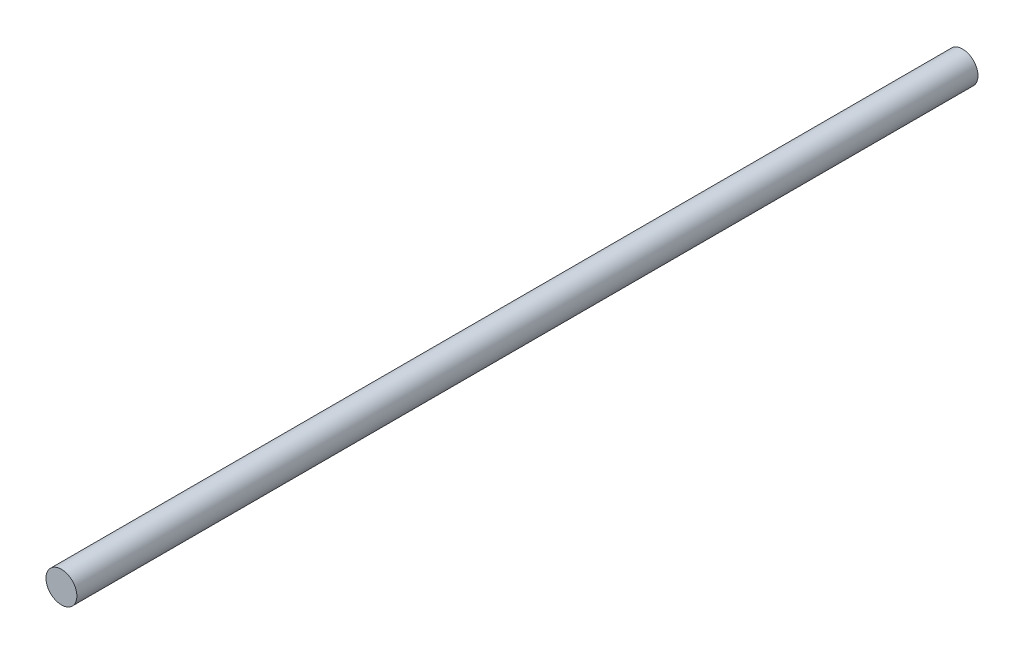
ISO-10303-21;
HEADER;
FILE_DESCRIPTION(('STEP AP214'),'2;1');
FILE_NAME('part.step','',(''),(''),'','','');
FILE_SCHEMA(('AUTOMOTIVE_DESIGN { 1 0 10303 214 1 1 1 1 }'));
ENDSEC;
DATA;
#1=APPLICATION_CONTEXT('core data for automotive mechanical design processes');
#2=APPLICATION_PROTOCOL_DEFINITION('international standard','automotive_design',2000,#1);
#3=PRODUCT_CONTEXT('',#1,'mechanical');
#4=PRODUCT('Part','Part','',(#3));
#5=PRODUCT_RELATED_PRODUCT_CATEGORY('part','',(#4));
#6=PRODUCT_DEFINITION_FORMATION('','',#4);
#7=PRODUCT_DEFINITION_CONTEXT('part definition',#1,'design');
#8=PRODUCT_DEFINITION('design','',#6,#7);
#9=PRODUCT_DEFINITION_SHAPE('','',#8);
#10=(LENGTH_UNIT() NAMED_UNIT(*) SI_UNIT(.MILLI.,.METRE.));
#11=(NAMED_UNIT(*) PLANE_ANGLE_UNIT() SI_UNIT($,.RADIAN.));
#12=(NAMED_UNIT(*) SI_UNIT($,.STERADIAN.) SOLID_ANGLE_UNIT());
#13=UNCERTAINTY_MEASURE_WITH_UNIT(LENGTH_MEASURE(1.E-05),#10,'distance_accuracy_value','');
#14=(GEOMETRIC_REPRESENTATION_CONTEXT(3) GLOBAL_UNCERTAINTY_ASSIGNED_CONTEXT((#13)) GLOBAL_UNIT_ASSIGNED_CONTEXT((#10,
#11,#12)) REPRESENTATION_CONTEXT('',''));
#15=CARTESIAN_POINT('',(0.,0.,0.));
#16=DIRECTION('',(0.,0.,1.));
#17=DIRECTION('',(1.,0.,0.));
#18=AXIS2_PLACEMENT_3D('',#15,#16,#17);
#19=CARTESIAN_POINT('',(0.,0.,-1750.));
#20=DIRECTION('',(0.,0.,1.));
#21=DIRECTION('',(1.,0.,0.));
#22=AXIS2_PLACEMENT_3D('',#19,#20,#21);
#23=CYLINDRICAL_SURFACE('',#22,30.);
#24=CARTESIAN_POINT('',(0.,0.,-1750.));
#25=DIRECTION('',(0.,0.,1.));
#26=DIRECTION('',(1.,0.,0.));
#27=AXIS2_PLACEMENT_3D('',#24,#25,#26);
#28=CIRCLE('',#27,30.);
#29=CARTESIAN_POINT('',(30.,0.,-1750.));
#30=VERTEX_POINT('',#29);
#31=EDGE_CURVE('E10',#30,#30,#28,.T.);
#32=ORIENTED_EDGE('',*,*,#31,.T.);
#33=EDGE_LOOP('',(#32));
#34=FACE_BOUND('',#33,.T.);
#35=CARTESIAN_POINT('',(0.,0.,0.));
#36=DIRECTION('',(0.,0.,1.));
#37=DIRECTION('',(1.,0.,0.));
#38=AXIS2_PLACEMENT_3D('',#35,#36,#37);
#39=CIRCLE('',#38,30.);
#40=CARTESIAN_POINT('',(30.,0.,0.));
#41=VERTEX_POINT('',#40);
#42=EDGE_CURVE('E40',#41,#41,#39,.T.);
#43=ORIENTED_EDGE('',*,*,#42,.F.);
#44=EDGE_LOOP('',(#43));
#45=FACE_BOUND('',#44,.T.);
#46=ADVANCED_FACE('F37',(#34,#45),#23,.T.);
#47=CARTESIAN_POINT('',(0.,0.,-1750.));
#48=DIRECTION('',(0.,0.,1.));
#49=DIRECTION('',(1.,0.,0.));
#50=AXIS2_PLACEMENT_3D('',#47,#48,#49);
#51=PLANE('',#50);
#52=ORIENTED_EDGE('',*,*,#31,.F.);
#53=EDGE_LOOP('',(#52));
#54=FACE_BOUND('',#53,.T.);
#55=ADVANCED_FACE('F54',(#54),#51,.F.);
#56=CARTESIAN_POINT('',(0.,0.,0.));
#57=DIRECTION('',(0.,0.,1.));
#58=DIRECTION('',(1.,0.,0.));
#59=AXIS2_PLACEMENT_3D('',#56,#57,#58);
#60=PLANE('',#59);
#61=ORIENTED_EDGE('',*,*,#42,.T.);
#62=EDGE_LOOP('',(#61));
#63=FACE_BOUND('',#62,.T.);
#64=ADVANCED_FACE('F51',(#63),#60,.T.);
#65=CLOSED_SHELL('',(#46,#55,#64));
#66=MANIFOLD_SOLID_BREP('B2',#65);
#67=ADVANCED_BREP_SHAPE_REPRESENTATION('',(#18,#66),#14);
#68=SHAPE_DEFINITION_REPRESENTATION(#9,#67);
ENDSEC;
END-ISO-10303-21;
